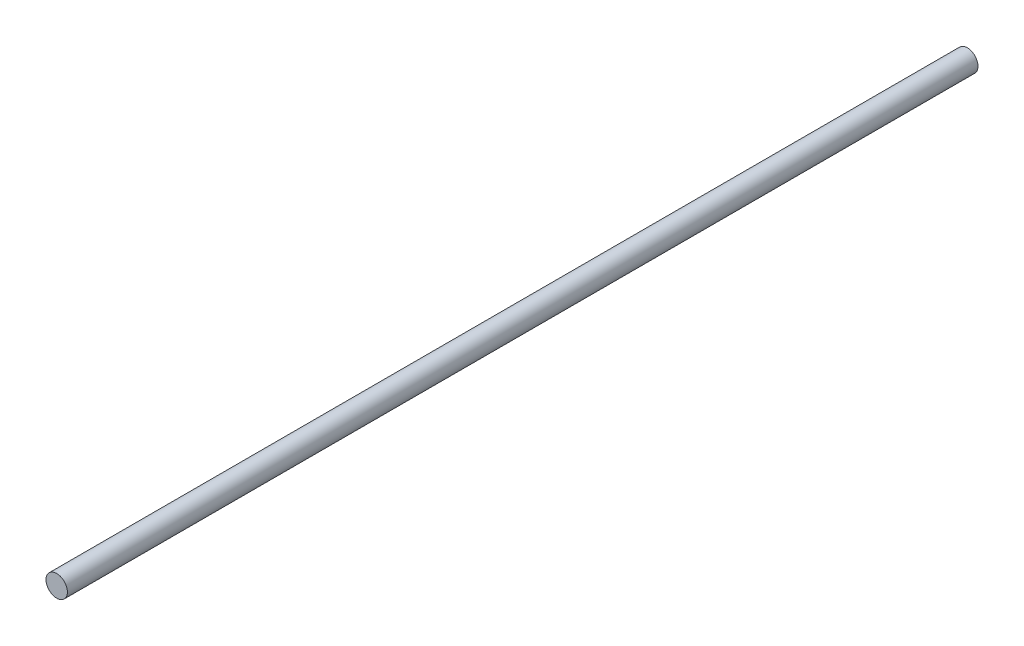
ISO-10303-21;
HEADER;
FILE_DESCRIPTION(('STEP AP214'),'2;1');
FILE_NAME('part.step','',(''),(''),'','','');
FILE_SCHEMA(('AUTOMOTIVE_DESIGN { 1 0 10303 214 1 1 1 1 }'));
ENDSEC;
DATA;
#1=APPLICATION_CONTEXT('core data for automotive mechanical design processes');
#2=APPLICATION_PROTOCOL_DEFINITION('international standard','automotive_design',2000,#1);
#3=PRODUCT_CONTEXT('',#1,'mechanical');
#4=PRODUCT('Part','Part','',(#3));
#5=PRODUCT_RELATED_PRODUCT_CATEGORY('part','',(#4));
#6=PRODUCT_DEFINITION_FORMATION('','',#4);
#7=PRODUCT_DEFINITION_CONTEXT('part definition',#1,'design');
#8=PRODUCT_DEFINITION('design','',#6,#7);
#9=PRODUCT_DEFINITION_SHAPE('','',#8);
#10=(LENGTH_UNIT() NAMED_UNIT(*) SI_UNIT(.MILLI.,.METRE.));
#11=(NAMED_UNIT(*) PLANE_ANGLE_UNIT() SI_UNIT($,.RADIAN.));
#12=(NAMED_UNIT(*) SI_UNIT($,.STERADIAN.) SOLID_ANGLE_UNIT());
#13=UNCERTAINTY_MEASURE_WITH_UNIT(LENGTH_MEASURE(1.E-05),#10,'distance_accuracy_value','');
#14=(GEOMETRIC_REPRESENTATION_CONTEXT(3) GLOBAL_UNCERTAINTY_ASSIGNED_CONTEXT((#13)) GLOBAL_UNIT_ASSIGNED_CONTEXT((#10,
#11,#12)) REPRESENTATION_CONTEXT('',''));
#15=CARTESIAN_POINT('',(0.,0.,0.));
#16=DIRECTION('',(0.,0.,1.));
#17=DIRECTION('',(1.,0.,0.));
#18=AXIS2_PLACEMENT_3D('',#15,#16,#17);
#19=CARTESIAN_POINT('',(0.,0.,-2550.));
#20=DIRECTION('',(0.,0.,1.));
#21=DIRECTION('',(1.,0.,0.));
#22=AXIS2_PLACEMENT_3D('',#19,#20,#21);
#23=CYLINDRICAL_SURFACE('',#22,30.);
#24=CARTESIAN_POINT('',(0.,0.,-2550.));
#25=DIRECTION('',(0.,0.,1.));
#26=DIRECTION('',(1.,0.,0.));
#27=AXIS2_PLACEMENT_3D('',#24,#25,#26);
#28=CIRCLE('',#27,30.);
#29=CARTESIAN_POINT('',(30.,0.,-2550.));
#30=VERTEX_POINT('',#29);
#31=EDGE_CURVE('E10',#30,#30,#28,.T.);
#32=ORIENTED_EDGE('',*,*,#31,.T.);
#33=EDGE_LOOP('',(#32));
#34=FACE_BOUND('',#33,.T.);
#35=CARTESIAN_POINT('',(0.,0.,0.));
#36=DIRECTION('',(0.,0.,1.));
#37=DIRECTION('',(1.,0.,0.));
#38=AXIS2_PLACEMENT_3D('',#35,#36,#37);
#39=CIRCLE('',#38,30.);
#40=CARTESIAN_POINT('',(30.,0.,0.));
#41=VERTEX_POINT('',#40);
#42=EDGE_CURVE('E40',#41,#41,#39,.T.);
#43=ORIENTED_EDGE('',*,*,#42,.F.);
#44=EDGE_LOOP('',(#43));
#45=FACE_BOUND('',#44,.T.);
#46=ADVANCED_FACE('F37',(#34,#45),#23,.T.);
#47=CARTESIAN_POINT('',(0.,0.,-2550.));
#48=DIRECTION('',(0.,0.,1.));
#49=DIRECTION('',(1.,0.,0.));
#50=AXIS2_PLACEMENT_3D('',#47,#48,#49);
#51=PLANE('',#50);
#52=ORIENTED_EDGE('',*,*,#31,.F.);
#53=EDGE_LOOP('',(#52));
#54=FACE_BOUND('',#53,.T.);
#55=ADVANCED_FACE('F54',(#54),#51,.F.);
#56=CARTESIAN_POINT('',(0.,0.,0.));
#57=DIRECTION('',(0.,0.,1.));
#58=DIRECTION('',(1.,0.,0.));
#59=AXIS2_PLACEMENT_3D('',#56,#57,#58);
#60=PLANE('',#59);
#61=ORIENTED_EDGE('',*,*,#42,.T.);
#62=EDGE_LOOP('',(#61));
#63=FACE_BOUND('',#62,.T.);
#64=ADVANCED_FACE('F51',(#63),#60,.T.);
#65=CLOSED_SHELL('',(#46,#55,#64));
#66=MANIFOLD_SOLID_BREP('B2',#65);
#67=ADVANCED_BREP_SHAPE_REPRESENTATION('',(#18,#66),#14);
#68=SHAPE_DEFINITION_REPRESENTATION(#9,#67);
ENDSEC;
END-ISO-10303-21;
